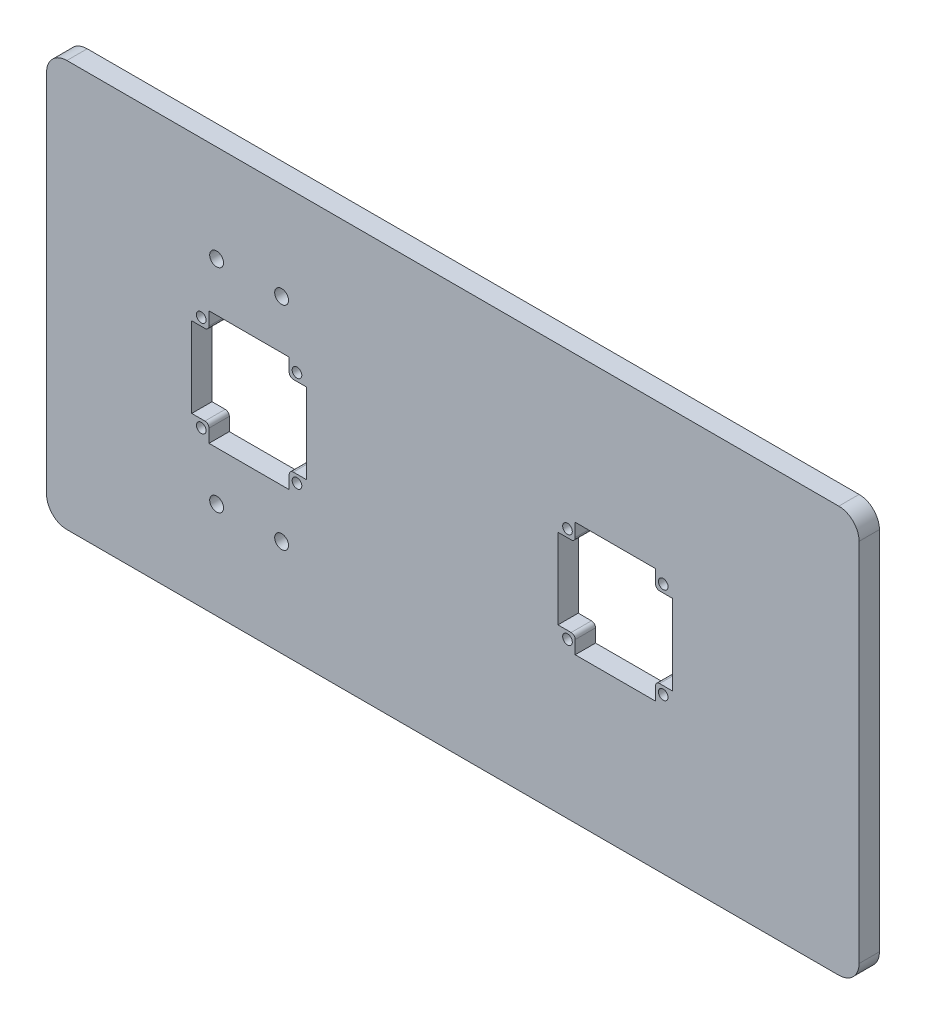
from build123d import *

# Parameters (mm, degrees)
SKETCH1_W           = 400
SKETCH1_H           = 200
SKETCH1_W_2         = 8.5
SKETCH1_H_2         = 8.5
BOSS_EXTRUDE1_DEPTH = 10
FILLET2_R           = 2
CUT_EXTRUDE1_REACH  = 225.83
SKETCH2_R           = 2.375
FILLET3_R           = 10
SKETCH3_R           = 3.4
CUT_EXTRUDE3_DEPTH  = 20


with BuildPart() as part:
    # Sketch1 → Boss-Extrude1 (new body)
    # profile 1 of 9: a face of its own
    with BuildSketch(Plane.XY):
        Rectangle(SKETCH1_W, SKETCH1_H)
        Polygon((-128.55, 28.25), (-120.05, 28.25), (-80.55, 28.25), (-72.05, 28.25), (-72.05, 19.75), (-72.05, -19.75), (-72.05, -28.25), (-80.55, -28.25), (-120.05, -28.25), (-128.55, -28.25), (-128.55, -19.75), (-128.55, 19.75), align=None, mode=Mode.SUBTRACT)
        Polygon((51.75, 19.75), (51.75, 28.25), (60.25, 28.25), (99.75, 28.25), (108.25, 28.25), (108.25, 19.75), (108.25, -19.75), (108.25, -28.25), (99.75, -28.25), (60.25, -28.25), (51.75, -28.25), (51.75, -19.75), align=None, mode=Mode.SUBTRACT)
    # profile 2 of 9: a face of its own
    with BuildSketch(Plane.XY):
        with Locations((-124.3, 24)):
            Rectangle(SKETCH1_W_2, SKETCH1_H_2)
    # profile 3 of 9: a face of its own
    with BuildSketch(Plane.XY):
        with Locations((-76.3, 24)):
            Rectangle(SKETCH1_W_2, SKETCH1_H_2)
    # profile 4 of 9: a face of its own
    with BuildSketch(Plane.XY):
        with Locations((-76.3, -24)):
            Rectangle(SKETCH1_W_2, SKETCH1_H_2)
    # profile 5 of 9: a face of its own
    with BuildSketch(Plane.XY):
        with Locations((-124.3, -24)):
            Rectangle(SKETCH1_W_2, SKETCH1_H_2)
    # profile 6 of 9: a face of its own
    with BuildSketch(Plane.XY):
        with Locations((56, -24)):
            Rectangle(SKETCH1_W_2, SKETCH1_H_2)
    # profile 7 of 9: a face of its own
    with BuildSketch(Plane.XY):
        with Locations((56, 24)):
            Rectangle(SKETCH1_W_2, SKETCH1_H_2)
    # profile 8 of 9: a face of its own
    with BuildSketch(Plane.XY):
        with Locations((104, 24)):
            Rectangle(SKETCH1_W_2, SKETCH1_H_2)
    # profile 9 of 9: a face of its own
    with BuildSketch(Plane.XY):
        with Locations((104, -24)):
            Rectangle(SKETCH1_W_2, SKETCH1_H_2)
    extrude(amount=BOSS_EXTRUDE1_DEPTH)

    # Fillet2
    fillet2_edges = [part.edges().sort_by_distance(p)[0] for p in [
        (60.25, 19.75, 5),
        (60.25, -19.75, 5),
        (99.75, -19.75, 5),
        (99.75, 19.75, 5),
        (-80.55, 19.75, 5),
        (-120.05, 19.75, 5),
        (-120.05, -19.75, 5),
        (-80.55, -19.75, 5),
    ]]
    fillet(fillet2_edges, radius=FILLET2_R)

    # Sketch2 → Cut-Extrude1 (cut, up to next)
    with BuildSketch(Plane(origin=(0, 0, 0), x_dir=(-1, 0, 0), z_dir=(0, 0, -1)), mode=Mode.PRIVATE) as cut_extrude1_sk1:
        with Locations((-103.57, 23.57)):
            Circle(SKETCH2_R)
    cut_extrude1_tool1 = extrude(cut_extrude1_sk1.sketch, amount=-CUT_EXTRUDE1_REACH, mode=Mode.PRIVATE) & part.part
    # Sketch2 → Cut-Extrude1 (cut, up to next)
    with BuildSketch(Plane(origin=(0, 0, 0), x_dir=(-1, 0, 0), z_dir=(0, 0, -1)), mode=Mode.PRIVATE) as cut_extrude1_sk2:
        with Locations((-56.43, 23.57)):
            Circle(SKETCH2_R)
    cut_extrude1_tool2 = extrude(cut_extrude1_sk2.sketch, amount=-CUT_EXTRUDE1_REACH, mode=Mode.PRIVATE) & part.part
    # Sketch2 → Cut-Extrude1 (cut, up to next)
    with BuildSketch(Plane(origin=(0, 0, 0), x_dir=(-1, 0, 0), z_dir=(0, 0, -1)), mode=Mode.PRIVATE) as cut_extrude1_sk3:
        with Locations((-56.43, -23.57)):
            Circle(SKETCH2_R)
    cut_extrude1_tool3 = extrude(cut_extrude1_sk3.sketch, amount=-CUT_EXTRUDE1_REACH, mode=Mode.PRIVATE) & part.part
    # Sketch2 → Cut-Extrude1 (cut, up to next)
    with BuildSketch(Plane(origin=(0, 0, 0), x_dir=(-1, 0, 0), z_dir=(0, 0, -1)), mode=Mode.PRIVATE) as cut_extrude1_sk4:
        with Locations((-103.57, -23.57)):
            Circle(SKETCH2_R)
    cut_extrude1_tool4 = extrude(cut_extrude1_sk4.sketch, amount=-CUT_EXTRUDE1_REACH, mode=Mode.PRIVATE) & part.part
    # Sketch2 → Cut-Extrude1 (cut, up to next)
    with BuildSketch(Plane(origin=(0, 0, 0), x_dir=(-1, 0, 0), z_dir=(0, 0, -1)), mode=Mode.PRIVATE) as cut_extrude1_sk5:
        with Locations(Location((123.87, -23.57, 0), (0, 0, 180))):
            Circle(SKETCH2_R)
    cut_extrude1_tool5 = extrude(cut_extrude1_sk5.sketch, amount=-CUT_EXTRUDE1_REACH, mode=Mode.PRIVATE) & part.part
    # Sketch2 → Cut-Extrude1 (cut, up to next)
    with BuildSketch(Plane(origin=(0, 0, 0), x_dir=(-1, 0, 0), z_dir=(0, 0, -1)), mode=Mode.PRIVATE) as cut_extrude1_sk6:
        with Locations(Location((76.73, -23.57, 0), (0, 0, 180))):
            Circle(SKETCH2_R)
    cut_extrude1_tool6 = extrude(cut_extrude1_sk6.sketch, amount=-CUT_EXTRUDE1_REACH, mode=Mode.PRIVATE) & part.part
    # Sketch2 → Cut-Extrude1 (cut, up to next)
    with BuildSketch(Plane(origin=(0, 0, 0), x_dir=(-1, 0, 0), z_dir=(0, 0, -1)), mode=Mode.PRIVATE) as cut_extrude1_sk7:
        with Locations(Location((76.73, 23.57, 0), (0, 0, 180))):
            Circle(SKETCH2_R)
    cut_extrude1_tool7 = extrude(cut_extrude1_sk7.sketch, amount=-CUT_EXTRUDE1_REACH, mode=Mode.PRIVATE) & part.part
    # Sketch2 → Cut-Extrude1 (cut, up to next)
    with BuildSketch(Plane(origin=(0, 0, 0), x_dir=(-1, 0, 0), z_dir=(0, 0, -1)), mode=Mode.PRIVATE) as cut_extrude1_sk8:
        with Locations(Location((123.87, 23.57, 0), (0, 0, 180))):
            Circle(SKETCH2_R)
    cut_extrude1_tool8 = extrude(cut_extrude1_sk8.sketch, amount=-CUT_EXTRUDE1_REACH, mode=Mode.PRIVATE) & part.part
    add(cut_extrude1_tool1.solids().sort_by_distance((103.57, 23.57, 0))[0], mode=Mode.SUBTRACT)
    add(cut_extrude1_tool2.solids().sort_by_distance((56.43, 23.57, 0))[0], mode=Mode.SUBTRACT)
    add(cut_extrude1_tool3.solids().sort_by_distance((56.43, -23.57, 0))[0], mode=Mode.SUBTRACT)
    add(cut_extrude1_tool4.solids().sort_by_distance((103.57, -23.57, 0))[0], mode=Mode.SUBTRACT)
    add(cut_extrude1_tool5.solids().sort_by_distance((-123.87, -23.57, 0))[0], mode=Mode.SUBTRACT)
    add(cut_extrude1_tool6.solids().sort_by_distance((-76.73, -23.57, 0))[0], mode=Mode.SUBTRACT)
    add(cut_extrude1_tool7.solids().sort_by_distance((-76.73, 23.57, 0))[0], mode=Mode.SUBTRACT)
    add(cut_extrude1_tool8.solids().sort_by_distance((-123.87, 23.57, 0))[0], mode=Mode.SUBTRACT)

    # Fillet3
    fillet3_edges = [part.edges().sort_by_distance(p)[0] for p in [
        (-200, 100, 5),
        (200, 100, 5),
        (200, -100, 5),
        (-200, -100, 5),
    ]]
    fillet(fillet3_edges, radius=FILLET3_R)

    # Sketch3 → Cut-Extrude3 (cut)
    with BuildSketch(Plane(origin=(0, 0, 0), x_dir=(-1, 0, 0), z_dir=(0, 0, -1))):
        with Locations((84.3, -52.25)):
            Circle(SKETCH3_R)
        with Locations((116.3, -52.25)):
            Circle(SKETCH3_R)
        with Locations((84.3, 52.25)):
            Circle(SKETCH3_R)
        with Locations((116.3, 52.25)):
            Circle(SKETCH3_R)
    extrude(amount=-CUT_EXTRUDE3_DEPTH, mode=Mode.SUBTRACT)


solid = part.part
